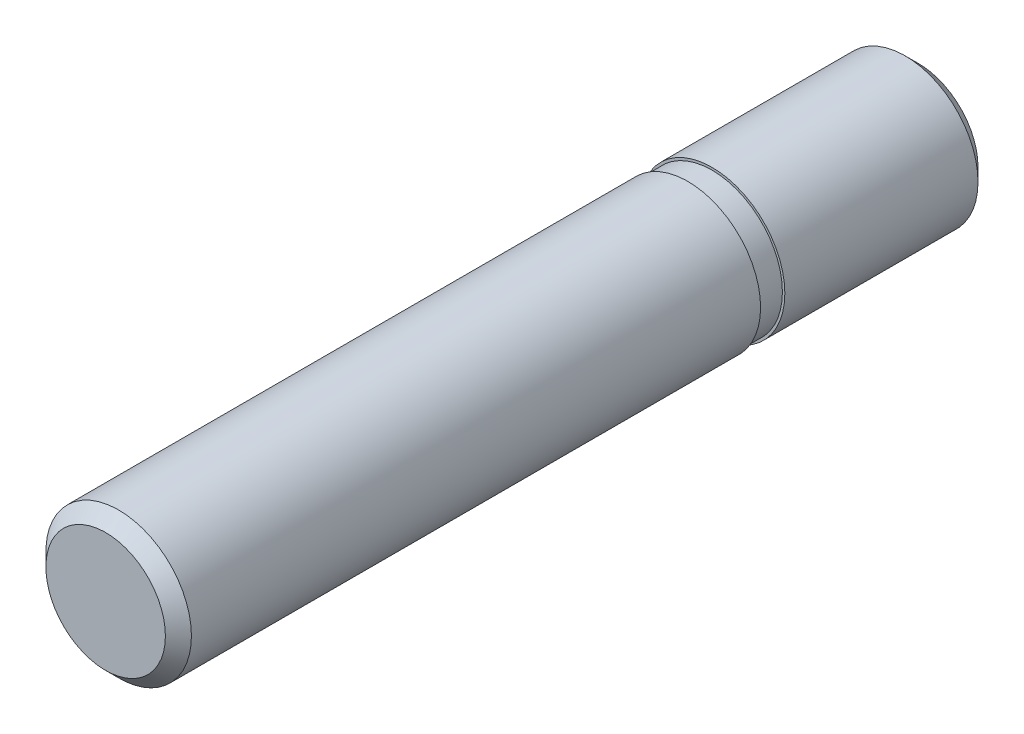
ISO-10303-21;
HEADER;
FILE_DESCRIPTION(('STEP AP214'),'2;1');
FILE_NAME('part.step','',(''),(''),'','','');
FILE_SCHEMA(('AUTOMOTIVE_DESIGN { 1 0 10303 214 1 1 1 1 }'));
ENDSEC;
DATA;
#1=APPLICATION_CONTEXT('core data for automotive mechanical design processes');
#2=APPLICATION_PROTOCOL_DEFINITION('international standard','automotive_design',2000,#1);
#3=PRODUCT_CONTEXT('',#1,'mechanical');
#4=PRODUCT('Part','Part','',(#3));
#5=PRODUCT_RELATED_PRODUCT_CATEGORY('part','',(#4));
#6=PRODUCT_DEFINITION_FORMATION('','',#4);
#7=PRODUCT_DEFINITION_CONTEXT('part definition',#1,'design');
#8=PRODUCT_DEFINITION('design','',#6,#7);
#9=PRODUCT_DEFINITION_SHAPE('','',#8);
#10=(LENGTH_UNIT() NAMED_UNIT(*) SI_UNIT(.MILLI.,.METRE.));
#11=(NAMED_UNIT(*) PLANE_ANGLE_UNIT() SI_UNIT($,.RADIAN.));
#12=(NAMED_UNIT(*) SI_UNIT($,.STERADIAN.) SOLID_ANGLE_UNIT());
#13=UNCERTAINTY_MEASURE_WITH_UNIT(LENGTH_MEASURE(1.E-05),#10,'distance_accuracy_value','');
#14=(GEOMETRIC_REPRESENTATION_CONTEXT(3) GLOBAL_UNCERTAINTY_ASSIGNED_CONTEXT((#13)) GLOBAL_UNIT_ASSIGNED_CONTEXT((#10,
#11,#12)) REPRESENTATION_CONTEXT('',''));
#15=CARTESIAN_POINT('',(0.,0.,0.));
#16=DIRECTION('',(0.,0.,1.));
#17=DIRECTION('',(1.,0.,0.));
#18=AXIS2_PLACEMENT_3D('',#15,#16,#17);
#19=CARTESIAN_POINT('',(0.,2.46325,-17.));
#20=DIRECTION('',(0.,0.,-1.));
#21=DIRECTION('',(-1.,0.,0.));
#22=AXIS2_PLACEMENT_3D('',#19,#20,#21);
#23=PLANE('',#22);
#24=CARTESIAN_POINT('',(0.,0.,-17.0000000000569));
#25=DIRECTION('',(0.,0.,1.));
#26=DIRECTION('',(1.,0.,0.));
#27=AXIS2_PLACEMENT_3D('',#24,#25,#26);
#28=CIRCLE('',#27,4.92649999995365);
#29=CARTESIAN_POINT('',(4.92649999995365,0.,-17.0000000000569));
#30=VERTEX_POINT('',#29);
#31=EDGE_CURVE('E19',#30,#30,#28,.T.);
#32=ORIENTED_EDGE('',*,*,#31,.F.);
#33=EDGE_LOOP('',(#32));
#34=FACE_BOUND('',#33,.T.);
#35=ADVANCED_FACE('F12',(#34),#23,.T.);
#36=CARTESIAN_POINT('',(0.,0.,-15.9264999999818));
#37=DIRECTION('',(0.,0.,1.));
#38=DIRECTION('',(1.,0.,0.));
#39=AXIS2_PLACEMENT_3D('',#36,#37,#38);
#40=CONICAL_SURFACE('',#39,6.00000000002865,0.785398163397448);
#41=CARTESIAN_POINT('',(0.,0.,-15.9265));
#42=DIRECTION('',(0.,0.,1.));
#43=DIRECTION('',(1.,0.,0.));
#44=AXIS2_PLACEMENT_3D('',#41,#42,#43);
#45=CIRCLE('',#44,6.);
#46=CARTESIAN_POINT('',(6.,0.,-15.9265));
#47=VERTEX_POINT('',#46);
#48=EDGE_CURVE('E23',#47,#47,#45,.T.);
#49=ORIENTED_EDGE('',*,*,#48,.F.);
#50=EDGE_LOOP('',(#49));
#51=FACE_BOUND('',#50,.T.);
#52=ORIENTED_EDGE('',*,*,#31,.T.);
#53=EDGE_LOOP('',(#52));
#54=FACE_BOUND('',#53,.T.);
#55=ADVANCED_FACE('F66',(#51,#54),#40,.T.);
#56=CARTESIAN_POINT('',(0.,0.,7.5));
#57=DIRECTION('',(0.,0.,1.));
#58=DIRECTION('',(1.,0.,0.));
#59=AXIS2_PLACEMENT_3D('',#56,#57,#58);
#60=CYLINDRICAL_SURFACE('',#59,6.);
#61=CARTESIAN_POINT('',(0.,0.,0.));
#62=DIRECTION('',(0.,0.,1.));
#63=DIRECTION('',(1.,0.,0.));
#64=AXIS2_PLACEMENT_3D('',#61,#62,#63);
#65=CIRCLE('',#64,6.);
#66=CARTESIAN_POINT('',(6.,0.,0.));
#67=VERTEX_POINT('',#66);
#68=EDGE_CURVE('E28',#67,#67,#65,.T.);
#69=ORIENTED_EDGE('',*,*,#68,.F.);
#70=EDGE_LOOP('',(#69));
#71=FACE_BOUND('',#70,.T.);
#72=ORIENTED_EDGE('',*,*,#48,.T.);
#73=EDGE_LOOP('',(#72));
#74=FACE_BOUND('',#73,.T.);
#75=ADVANCED_FACE('F72',(#71,#74),#60,.T.);
#76=CARTESIAN_POINT('',(0.,0.,0.));
#77=DIRECTION('',(0.,0.,1.));
#78=DIRECTION('',(1.,0.,0.));
#79=AXIS2_PLACEMENT_3D('',#76,#77,#78);
#80=PLANE('',#79);
#81=CARTESIAN_POINT('',(0.,0.,0.));
#82=DIRECTION('',(0.,0.,1.));
#83=DIRECTION('',(1.,0.,0.));
#84=AXIS2_PLACEMENT_3D('',#81,#82,#83);
#85=CIRCLE('',#84,5.8);
#86=CARTESIAN_POINT('',(5.8,0.,0.));
#87=VERTEX_POINT('',#86);
#88=EDGE_CURVE('E8',#87,#87,#85,.T.);
#89=ORIENTED_EDGE('',*,*,#88,.F.);
#90=EDGE_LOOP('',(#89));
#91=FACE_BOUND('',#90,.T.);
#92=ORIENTED_EDGE('',*,*,#68,.T.);
#93=EDGE_LOOP('',(#92));
#94=FACE_BOUND('',#93,.T.);
#95=ADVANCED_FACE('F77',(#91,#94),#80,.T.);
#96=CARTESIAN_POINT('',(0.,0.,-2.99074767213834));
#97=DIRECTION('',(0.,0.,-1.));
#98=DIRECTION('',(-1.,0.,0.));
#99=AXIS2_PLACEMENT_3D('',#96,#97,#98);
#100=CYLINDRICAL_SURFACE('',#99,5.8);
#101=CARTESIAN_POINT('',(0.,0.,2.));
#102=DIRECTION('',(0.,0.,-1.));
#103=DIRECTION('',(-1.,0.,0.));
#104=AXIS2_PLACEMENT_3D('',#101,#102,#103);
#105=CIRCLE('',#104,5.8);
#106=CARTESIAN_POINT('',(-5.8,0.,2.));
#107=VERTEX_POINT('',#106);
#108=EDGE_CURVE('E44',#107,#107,#105,.T.);
#109=ORIENTED_EDGE('',*,*,#108,.T.);
#110=EDGE_LOOP('',(#109));
#111=FACE_BOUND('',#110,.T.);
#112=ORIENTED_EDGE('',*,*,#88,.T.);
#113=EDGE_LOOP('',(#112));
#114=FACE_BOUND('',#113,.T.);
#115=ADVANCED_FACE('F51',(#111,#114),#100,.T.);
#116=CARTESIAN_POINT('',(0.,0.,50.));
#117=DIRECTION('',(0.,0.,1.));
#118=DIRECTION('',(1.,0.,0.));
#119=AXIS2_PLACEMENT_3D('',#116,#117,#118);
#120=PLANE('',#119);
#121=CARTESIAN_POINT('',(0.,0.,50.));
#122=DIRECTION('',(0.,0.,1.));
#123=DIRECTION('',(1.,0.,0.));
#124=AXIS2_PLACEMENT_3D('',#121,#122,#123);
#125=CIRCLE('',#124,4.9265);
#126=CARTESIAN_POINT('',(4.9265,0.,50.));
#127=VERTEX_POINT('',#126);
#128=EDGE_CURVE('E40',#127,#127,#125,.T.);
#129=ORIENTED_EDGE('',*,*,#128,.T.);
#130=EDGE_LOOP('',(#129));
#131=FACE_BOUND('',#130,.T.);
#132=ADVANCED_FACE('F85',(#131),#120,.T.);
#133=CARTESIAN_POINT('',(0.,0.,50.));
#134=DIRECTION('',(0.,0.,-1.));
#135=DIRECTION('',(-1.,0.,0.));
#136=AXIS2_PLACEMENT_3D('',#133,#134,#135);
#137=CONICAL_SURFACE('',#136,4.9265,0.785398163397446);
#138=CARTESIAN_POINT('',(0.,0.,48.9265));
#139=DIRECTION('',(0.,0.,1.));
#140=DIRECTION('',(1.,0.,0.));
#141=AXIS2_PLACEMENT_3D('',#138,#139,#140);
#142=CIRCLE('',#141,6.);
#143=CARTESIAN_POINT('',(6.,0.,48.9265));
#144=VERTEX_POINT('',#143);
#145=EDGE_CURVE('E31',#144,#144,#142,.F.);
#146=ORIENTED_EDGE('',*,*,#145,.F.);
#147=EDGE_LOOP('',(#146));
#148=FACE_BOUND('',#147,.T.);
#149=ORIENTED_EDGE('',*,*,#128,.F.);
#150=EDGE_LOOP('',(#149));
#151=FACE_BOUND('',#150,.T.);
#152=ADVANCED_FACE('F62',(#148,#151),#137,.T.);
#153=CARTESIAN_POINT('',(0.,0.,7.5));
#154=DIRECTION('',(0.,0.,1.));
#155=DIRECTION('',(1.,0.,0.));
#156=AXIS2_PLACEMENT_3D('',#153,#154,#155);
#157=CYLINDRICAL_SURFACE('',#156,6.);
#158=CARTESIAN_POINT('',(0.,0.,2.));
#159=DIRECTION('',(0.,0.,1.));
#160=DIRECTION('',(1.,0.,0.));
#161=AXIS2_PLACEMENT_3D('',#158,#159,#160);
#162=CIRCLE('',#161,6.);
#163=CARTESIAN_POINT('',(6.,0.,2.));
#164=VERTEX_POINT('',#163);
#165=EDGE_CURVE('E35',#164,#164,#162,.T.);
#166=ORIENTED_EDGE('',*,*,#165,.T.);
#167=EDGE_LOOP('',(#166));
#168=FACE_BOUND('',#167,.T.);
#169=ORIENTED_EDGE('',*,*,#145,.T.);
#170=EDGE_LOOP('',(#169));
#171=FACE_BOUND('',#170,.T.);
#172=ADVANCED_FACE('F14',(#168,#171),#157,.T.);
#173=CARTESIAN_POINT('',(0.,0.,2.));
#174=DIRECTION('',(0.,0.,1.));
#175=DIRECTION('',(1.,0.,0.));
#176=AXIS2_PLACEMENT_3D('',#173,#174,#175);
#177=PLANE('',#176);
#178=ORIENTED_EDGE('',*,*,#108,.F.);
#179=EDGE_LOOP('',(#178));
#180=FACE_BOUND('',#179,.T.);
#181=ORIENTED_EDGE('',*,*,#165,.F.);
#182=EDGE_LOOP('',(#181));
#183=FACE_BOUND('',#182,.T.);
#184=ADVANCED_FACE('F53',(#180,#183),#177,.F.);
#185=CLOSED_SHELL('',(#35,#55,#75,#95,#115,#132,#152,#172,#184));
#186=MANIFOLD_SOLID_BREP('B1',#185);
#187=ADVANCED_BREP_SHAPE_REPRESENTATION('',(#18,#186),#14);
#188=SHAPE_DEFINITION_REPRESENTATION(#9,#187);
ENDSEC;
END-ISO-10303-21;
